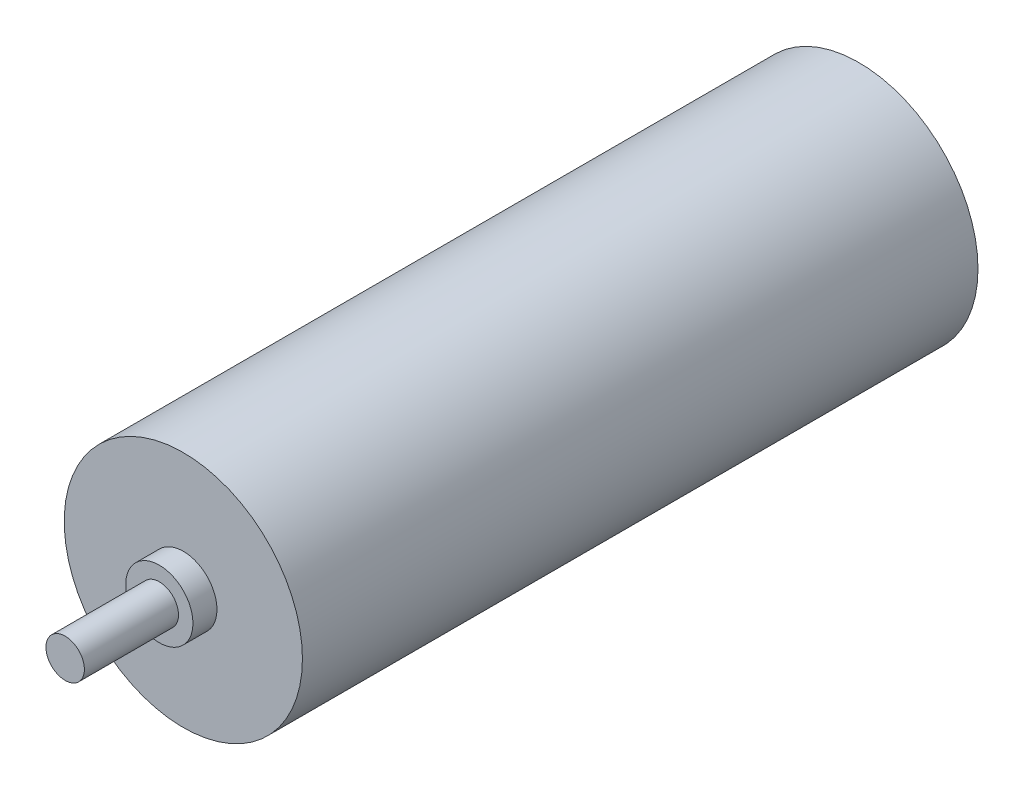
from build123d import *

# Parameters (mm, degrees)
ESQUISSE1_R        = 12.4
BOSS_EXTRU_1_DEPTH = 70.33
ESQUISSE2_R        = 3.5
BOSS_EXTRU_2_DEPTH = 2.5
ESQUISSE3_R        = 2
BOSS_EXTRU_3_DEPTH = 9.8


with BuildPart() as part:
    # Esquisse1 → Boss.-Extru.1 (new body)
    with BuildSketch(Plane.XY):
        Circle(ESQUISSE1_R)
    extrude(amount=BOSS_EXTRU_1_DEPTH)

    # Esquisse2 → Boss.-Extru.2 (add)
    with BuildSketch(Plane.XY.offset(70.33)):
        Circle(ESQUISSE2_R)
    extrude(amount=BOSS_EXTRU_2_DEPTH)

    # Esquisse3 → Boss.-Extru.3 (add)
    with BuildSketch(Plane.XY.offset(72.83)):
        Circle(ESQUISSE3_R)
    extrude(amount=BOSS_EXTRU_3_DEPTH)


solid = part.part
